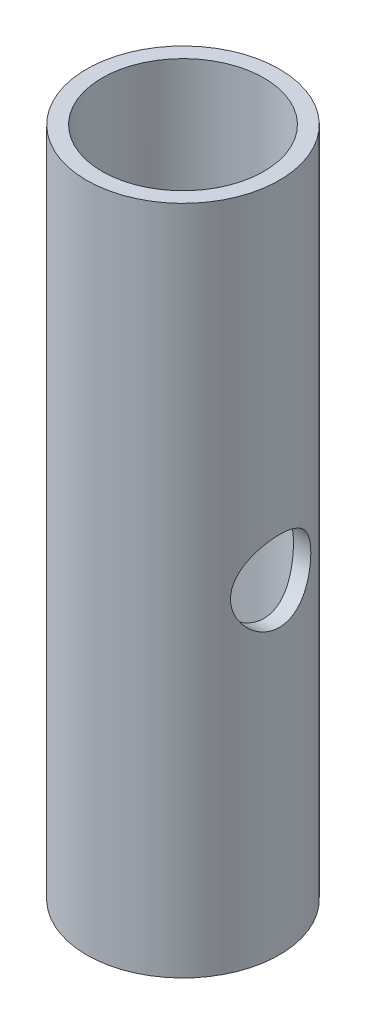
ISO-10303-21;
HEADER;
FILE_DESCRIPTION(('STEP AP214'),'2;1');
FILE_NAME('part.step','',(''),(''),'','','');
FILE_SCHEMA(('AUTOMOTIVE_DESIGN { 1 0 10303 214 1 1 1 1 }'));
ENDSEC;
DATA;
#1=APPLICATION_CONTEXT('core data for automotive mechanical design processes');
#2=APPLICATION_PROTOCOL_DEFINITION('international standard','automotive_design',2000,#1);
#3=PRODUCT_CONTEXT('',#1,'mechanical');
#4=PRODUCT('Part','Part','',(#3));
#5=PRODUCT_RELATED_PRODUCT_CATEGORY('part','',(#4));
#6=PRODUCT_DEFINITION_FORMATION('','',#4);
#7=PRODUCT_DEFINITION_CONTEXT('part definition',#1,'design');
#8=PRODUCT_DEFINITION('design','',#6,#7);
#9=PRODUCT_DEFINITION_SHAPE('','',#8);
#10=(LENGTH_UNIT() NAMED_UNIT(*) SI_UNIT(.MILLI.,.METRE.));
#11=(NAMED_UNIT(*) PLANE_ANGLE_UNIT() SI_UNIT($,.RADIAN.));
#12=(NAMED_UNIT(*) SI_UNIT($,.STERADIAN.) SOLID_ANGLE_UNIT());
#13=UNCERTAINTY_MEASURE_WITH_UNIT(LENGTH_MEASURE(1.E-05),#10,'distance_accuracy_value','');
#14=(GEOMETRIC_REPRESENTATION_CONTEXT(3) GLOBAL_UNCERTAINTY_ASSIGNED_CONTEXT((#13)) GLOBAL_UNIT_ASSIGNED_CONTEXT((#10,
#11,#12)) REPRESENTATION_CONTEXT('',''));
#15=CARTESIAN_POINT('',(0.,0.,0.));
#16=DIRECTION('',(0.,0.,1.));
#17=DIRECTION('',(1.,0.,0.));
#18=AXIS2_PLACEMENT_3D('',#15,#16,#17);
#19=CARTESIAN_POINT('',(0.,16.5735,0.));
#20=DIRECTION('',(0.,1.,0.));
#21=DIRECTION('',(0.,0.,1.));
#22=AXIS2_PLACEMENT_3D('',#19,#20,#21);
#23=PLANE('',#22);
#24=CARTESIAN_POINT('',(0.,16.5735,0.));
#25=DIRECTION('',(0.,1.,0.));
#26=DIRECTION('',(0.,0.,1.));
#27=AXIS2_PLACEMENT_3D('',#24,#25,#26);
#28=CIRCLE('',#27,2.38125);
#29=CARTESIAN_POINT('',(0.,16.5735,2.38125));
#30=VERTEX_POINT('',#29);
#31=EDGE_CURVE('E10',#30,#30,#28,.T.);
#32=ORIENTED_EDGE('',*,*,#31,.T.);
#33=EDGE_LOOP('',(#32));
#34=FACE_BOUND('',#33,.T.);
#35=CARTESIAN_POINT('',(0.,16.5735,0.));
#36=DIRECTION('',(0.,1.,0.));
#37=DIRECTION('',(0.,0.,1.));
#38=AXIS2_PLACEMENT_3D('',#35,#36,#37);
#39=CIRCLE('',#38,2.);
#40=CARTESIAN_POINT('',(0.,16.5735,2.));
#41=VERTEX_POINT('',#40);
#42=EDGE_CURVE('E54',#41,#41,#39,.T.);
#43=ORIENTED_EDGE('',*,*,#42,.F.);
#44=EDGE_LOOP('',(#43));
#45=FACE_BOUND('',#44,.T.);
#46=ADVANCED_FACE('F35',(#34,#45),#23,.T.);
#47=CARTESIAN_POINT('',(0.,0.,0.));
#48=DIRECTION('',(0.,1.,0.));
#49=DIRECTION('',(0.,0.,1.));
#50=AXIS2_PLACEMENT_3D('',#47,#48,#49);
#51=PLANE('',#50);
#52=CARTESIAN_POINT('',(0.,0.,0.));
#53=DIRECTION('',(0.,1.,0.));
#54=DIRECTION('',(0.,0.,1.));
#55=AXIS2_PLACEMENT_3D('',#52,#53,#54);
#56=CIRCLE('',#55,2.38125);
#57=CARTESIAN_POINT('',(0.,0.,2.38125));
#58=VERTEX_POINT('',#57);
#59=EDGE_CURVE('E49',#58,#58,#56,.T.);
#60=ORIENTED_EDGE('',*,*,#59,.F.);
#61=EDGE_LOOP('',(#60));
#62=FACE_BOUND('',#61,.T.);
#63=CARTESIAN_POINT('',(0.,0.,0.));
#64=DIRECTION('',(0.,1.,0.));
#65=DIRECTION('',(0.,0.,1.));
#66=AXIS2_PLACEMENT_3D('',#63,#64,#65);
#67=CIRCLE('',#66,2.);
#68=CARTESIAN_POINT('',(0.,0.,2.));
#69=VERTEX_POINT('',#68);
#70=EDGE_CURVE('E57',#69,#69,#67,.T.);
#71=ORIENTED_EDGE('',*,*,#70,.T.);
#72=EDGE_LOOP('',(#71));
#73=FACE_BOUND('',#72,.T.);
#74=ADVANCED_FACE('F93',(#62,#73),#51,.F.);
#75=CARTESIAN_POINT('',(0.,16.5735,0.));
#76=DIRECTION('',(0.,-1.,0.));
#77=DIRECTION('',(0.,0.,-1.));
#78=AXIS2_PLACEMENT_3D('',#75,#76,#77);
#79=CYLINDRICAL_SURFACE('',#78,2.38125);
#80=CARTESIAN_POINT('',(-2.38125,7.0088125,0.));
#81=CARTESIAN_POINT('',(-2.38124570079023,7.00881821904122,-0.0531479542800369));
#82=CARTESIAN_POINT('',(-2.37945003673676,7.0131082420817,-0.106379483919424));
#83=CARTESIAN_POINT('',(-2.37244059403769,7.03011600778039,-0.211333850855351));
#84=CARTESIAN_POINT('',(-2.36721789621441,7.04285574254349,-0.263052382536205));
#85=CARTESIAN_POINT('',(-2.35391554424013,7.07621067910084,-0.363290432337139));
#86=CARTESIAN_POINT('',(-2.34584557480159,7.09679920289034,-0.411820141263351));
#87=CARTESIAN_POINT('',(-2.3276344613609,7.14515717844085,-0.504689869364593));
#88=CARTESIAN_POINT('',(-2.31749394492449,7.17292445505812,-0.549031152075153));
#89=CARTESIAN_POINT('',(-2.29558713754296,7.23632425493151,-0.634562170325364));
#90=CARTESIAN_POINT('',(-2.28376760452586,7.27225916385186,-0.67551400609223));
#91=CARTESIAN_POINT('',(-2.26006591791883,7.35033481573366,-0.751014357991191));
#92=CARTESIAN_POINT('',(-2.2481837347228,7.39247880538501,-0.785559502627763));
#93=CARTESIAN_POINT('',(-2.22504811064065,7.48429000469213,-0.848945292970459));
#94=CARTESIAN_POINT('',(-2.21385437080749,7.53422534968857,-0.877421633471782));
#95=CARTESIAN_POINT('',(-2.19420735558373,7.63871127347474,-0.925464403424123));
#96=CARTESIAN_POINT('',(-2.18575266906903,7.69325945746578,-0.94503542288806));
#97=CARTESIAN_POINT('',(-2.17311728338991,7.80268449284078,-0.973729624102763));
#98=CARTESIAN_POINT('',(-2.16875032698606,7.85741894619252,-0.983310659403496));
#99=CARTESIAN_POINT('',(-2.16424927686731,7.96787942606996,-0.993181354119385));
#100=CARTESIAN_POINT('',(-2.1641128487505,8.02360488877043,-0.99347613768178));
#101=CARTESIAN_POINT('',(-2.16793063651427,8.12990504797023,-0.985110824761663));
#102=CARTESIAN_POINT('',(-2.17157206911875,8.18054712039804,-0.97713546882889));
#103=CARTESIAN_POINT('',(-2.18200670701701,8.27969522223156,-0.953604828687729));
#104=CARTESIAN_POINT('',(-2.18880051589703,8.32820084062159,-0.938048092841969));
#105=CARTESIAN_POINT('',(-2.20492784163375,8.42292392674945,-0.899493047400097));
#106=CARTESIAN_POINT('',(-2.21431232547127,8.46907074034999,-0.876343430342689));
#107=CARTESIAN_POINT('',(-2.23455175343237,8.55700420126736,-0.823366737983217));
#108=CARTESIAN_POINT('',(-2.24540727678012,8.59878911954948,-0.793537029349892));
#109=CARTESIAN_POINT('',(-2.26848175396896,8.68052934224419,-0.725087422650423));
#110=CARTESIAN_POINT('',(-2.280738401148,8.72003158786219,-0.685937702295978));
#111=CARTESIAN_POINT('',(-2.3044600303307,8.79206196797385,-0.601447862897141));
#112=CARTESIAN_POINT('',(-2.31592482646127,8.82458846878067,-0.556106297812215));
#113=CARTESIAN_POINT('',(-2.3371038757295,8.88240843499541,-0.45914305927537));
#114=CARTESIAN_POINT('',(-2.34677161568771,8.90751762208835,-0.407400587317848));
#115=CARTESIAN_POINT('',(-2.36291025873,8.94851615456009,-0.299920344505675));
#116=CARTESIAN_POINT('',(-2.36938292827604,8.9644105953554,-0.244184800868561));
#117=CARTESIAN_POINT('',(-2.37807215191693,8.98558019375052,-0.134086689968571));
#118=CARTESIAN_POINT('',(-2.38053198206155,8.99146336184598,-0.0798602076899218));
#119=CARTESIAN_POINT('',(-2.38169489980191,8.99425606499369,0.0288565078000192));
#120=CARTESIAN_POINT('',(-2.38039906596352,8.99116817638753,0.0833466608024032));
#121=CARTESIAN_POINT('',(-2.37435404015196,8.97654170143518,0.188196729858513));
#122=CARTESIAN_POINT('',(-2.36977941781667,8.96543009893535,0.238627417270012));
#123=CARTESIAN_POINT('',(-2.35782331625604,8.93566587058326,0.336853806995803));
#124=CARTESIAN_POINT('',(-2.35044148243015,8.91701229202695,0.384649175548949));
#125=CARTESIAN_POINT('',(-2.333293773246,8.87208428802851,0.477924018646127));
#126=CARTESIAN_POINT('',(-2.32346096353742,8.84559112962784,0.523285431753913));
#127=CARTESIAN_POINT('',(-2.30246082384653,8.78597638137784,0.609081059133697));
#128=CARTESIAN_POINT('',(-2.29129293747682,8.75285202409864,0.649513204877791));
#129=CARTESIAN_POINT('',(-2.26783969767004,8.67814555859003,0.727339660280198));
#130=CARTESIAN_POINT('',(-2.25553152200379,8.63612818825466,0.764310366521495));
#131=CARTESIAN_POINT('',(-2.23190067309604,8.54628936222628,0.830794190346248));
#132=CARTESIAN_POINT('',(-2.22057822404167,8.49846659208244,0.860305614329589));
#133=CARTESIAN_POINT('',(-2.20012725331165,8.39738749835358,0.911351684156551));
#134=CARTESIAN_POINT('',(-2.1910322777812,8.34406348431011,0.932766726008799));
#135=CARTESIAN_POINT('',(-2.17652882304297,8.23406834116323,0.966131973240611));
#136=CARTESIAN_POINT('',(-2.17111730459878,8.17740001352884,0.978089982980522));
#137=CARTESIAN_POINT('',(-2.16505761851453,8.06702515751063,0.9914261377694));
#138=CARTESIAN_POINT('',(-2.16407484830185,8.01342642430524,0.993547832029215));
#139=CARTESIAN_POINT('',(-2.166094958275,7.90666847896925,0.989136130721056));
#140=CARTESIAN_POINT('',(-2.16909722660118,7.85350920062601,0.982604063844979));
#141=CARTESIAN_POINT('',(-2.17844331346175,7.75168888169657,0.961694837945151));
#142=CARTESIAN_POINT('',(-2.18462506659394,7.70293364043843,0.947697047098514));
#143=CARTESIAN_POINT('',(-2.19950650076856,7.6084525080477,0.912624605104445));
#144=CARTESIAN_POINT('',(-2.20820688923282,7.56272747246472,0.891547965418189));
#145=CARTESIAN_POINT('',(-2.2277939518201,7.47260388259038,0.841456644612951));
#146=CARTESIAN_POINT('',(-2.23878062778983,7.42845040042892,0.812040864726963));
#147=CARTESIAN_POINT('',(-2.26142303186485,7.34547351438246,0.746667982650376));
#148=CARTESIAN_POINT('',(-2.27307899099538,7.30665196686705,0.710708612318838));
#149=CARTESIAN_POINT('',(-2.29676636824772,7.23253198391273,0.630159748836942));
#150=CARTESIAN_POINT('',(-2.30876330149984,7.19769608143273,0.585132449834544));
#151=CARTESIAN_POINT('',(-2.33092738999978,7.13605105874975,0.48942631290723));
#152=CARTESIAN_POINT('',(-2.34109371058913,7.10924559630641,0.438744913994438));
#153=CARTESIAN_POINT('',(-2.35830414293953,7.06500218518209,0.333956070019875));
#154=CARTESIAN_POINT('',(-2.36539708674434,7.04741671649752,0.279919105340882));
#155=CARTESIAN_POINT('',(-2.37586051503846,7.02174560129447,0.169394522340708));
#156=CARTESIAN_POINT('',(-2.37924265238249,7.0136302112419,0.112915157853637));
#157=CARTESIAN_POINT('',(-2.38103003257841,7.00934180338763,0.0374936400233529));
#158=CARTESIAN_POINT('',(-2.38125151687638,7.00881048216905,0.0187520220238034));
#159=CARTESIAN_POINT('',(-2.38125,7.0088125,0.));
#160=B_SPLINE_CURVE_WITH_KNOTS('',3,(#80,#81,#82,#83,#84,#85,#86,#87,#88,#89,#90,#91,#92,#93,
#94,#95,#96,#97,#98,#99,#100,#101,#102,#103,#104,#105,#106,#107,#108,#109,#110,#111,#112,#113,
#114,#115,#116,#117,#118,#119,#120,#121,#122,#123,#124,#125,#126,#127,#128,#129,#130,#131,#132,
#133,#134,#135,#136,#137,#138,#139,#140,#141,#142,#143,#144,#145,#146,#147,#148,#149,#150,#151,
#152,#153,#154,#155,#156,#157,#158,#159),.UNSPECIFIED.,.T.,.F.,(4,2,2,2,2,2,2,2,2,2,2,2,2,2,2,2,
2,2,2,2,2,2,2,2,2,2,2,2,2,2,2,2,2,2,2,2,2,2,2,4),(0.,0.159390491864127,0.319197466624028,
0.478466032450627,0.637686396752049,0.804211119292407,0.970823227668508,1.14563306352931,
1.32035269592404,1.48665623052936,1.65286799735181,1.80633812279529,1.95983764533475,
2.11660353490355,2.27343133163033,2.44351287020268,2.61363419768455,2.78768218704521,
2.96163384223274,3.12458451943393,3.28748840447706,3.44230793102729,3.59714702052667,
3.75679601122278,3.91651176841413,4.08764174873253,4.25881054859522,4.43241738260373,
4.60588079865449,4.76599152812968,4.9260776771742,5.07871134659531,5.2313879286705,
5.3932446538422,5.55515758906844,5.72886312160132,5.90264765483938,6.07355954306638,
6.24393317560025,6.3001704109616),.UNSPECIFIED.);
#161=CARTESIAN_POINT('',(-2.38125,7.0088125,0.));
#162=VERTEX_POINT('',#161);
#163=EDGE_CURVE('E82',#162,#162,#160,.T.);
#164=ORIENTED_EDGE('',*,*,#163,.T.);
#165=EDGE_LOOP('',(#164));
#166=FACE_BOUND('',#165,.T.);
#167=CARTESIAN_POINT('',(2.16469756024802,8.001,-0.992187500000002));
#168=CARTESIAN_POINT('',(2.16470324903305,7.94807918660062,-0.992181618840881));
#169=CARTESIAN_POINT('',(2.1666665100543,7.89507195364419,-0.98792668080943));
#170=CARTESIAN_POINT('',(2.17427042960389,7.79058723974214,-0.971071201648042));
#171=CARTESIAN_POINT('',(2.17992107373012,7.73911431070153,-0.958447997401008));
#172=CARTESIAN_POINT('',(2.19413865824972,7.63939835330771,-0.925433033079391));
#173=CARTESIAN_POINT('',(2.20269369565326,7.59114308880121,-0.905072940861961));
#174=CARTESIAN_POINT('',(2.22173917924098,7.49874718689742,-0.857255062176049));
#175=CARTESIAN_POINT('',(2.23222916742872,7.45460557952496,-0.829798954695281));
#176=CARTESIAN_POINT('',(2.25469261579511,7.36891645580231,-0.766741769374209));
#177=CARTESIAN_POINT('',(2.26671638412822,7.32765587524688,-0.730768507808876));
#178=CARTESIAN_POINT('',(2.29047909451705,7.25154107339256,-0.652479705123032));
#179=CARTESIAN_POINT('',(2.30221792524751,7.21668932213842,-0.610161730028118));
#180=CARTESIAN_POINT('',(2.32469958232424,7.15291818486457,-0.518130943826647));
#181=CARTESIAN_POINT('',(2.33537712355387,7.12432167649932,-0.468177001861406));
#182=CARTESIAN_POINT('',(2.35391737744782,7.07606215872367,-0.363642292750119));
#183=CARTESIAN_POINT('',(2.36178133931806,7.0563951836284,-0.30906359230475));
#184=CARTESIAN_POINT('',(2.37345157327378,7.02759305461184,-0.199841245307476));
#185=CARTESIAN_POINT('',(2.37744770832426,7.0179630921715,-0.14534878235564));
#186=CARTESIAN_POINT('',(2.38162170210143,7.00790949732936,-0.0353847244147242));
#187=CARTESIAN_POINT('',(2.38180110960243,7.0074821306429,0.0200864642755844));
#188=CARTESIAN_POINT('',(2.37843321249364,7.01558658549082,0.126835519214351));
#189=CARTESIAN_POINT('',(2.37511204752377,7.02357474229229,0.178163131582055));
#190=CARTESIAN_POINT('',(2.36542672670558,7.04735152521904,0.278672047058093));
#191=CARTESIAN_POINT('',(2.35906234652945,7.06314072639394,0.32785319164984));
#192=CARTESIAN_POINT('',(2.34378382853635,7.10225913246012,0.423575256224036));
#193=CARTESIAN_POINT('',(2.3348322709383,7.12569969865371,0.470064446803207));
#194=CARTESIAN_POINT('',(2.31525535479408,7.17934631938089,0.558571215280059));
#195=CARTESIAN_POINT('',(2.3046294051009,7.20955476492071,0.600587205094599));
#196=CARTESIAN_POINT('',(2.28188598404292,7.27835604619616,0.682101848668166));
#197=CARTESIAN_POINT('',(2.26971617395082,7.31738979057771,0.721214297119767));
#198=CARTESIAN_POINT('',(2.24581926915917,7.40148970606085,0.792504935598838));
#199=CARTESIAN_POINT('',(2.23409234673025,7.44655819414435,0.824680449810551));
#200=CARTESIAN_POINT('',(2.2120352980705,7.54331981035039,0.88217525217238));
#201=CARTESIAN_POINT('',(2.20176374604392,7.59518198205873,0.907234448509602));
#202=CARTESIAN_POINT('',(2.18447813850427,7.70293182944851,0.948106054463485));
#203=CARTESIAN_POINT('',(2.17746175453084,7.75881659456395,0.963925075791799));
#204=CARTESIAN_POINT('',(2.1680583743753,7.86915559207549,0.984885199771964));
#205=CARTESIAN_POINT('',(2.16540055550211,7.92346739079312,0.990652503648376));
#206=CARTESIAN_POINT('',(2.16424102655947,8.03233604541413,0.993184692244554));
#207=CARTESIAN_POINT('',(2.16573787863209,8.08689281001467,0.98995269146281));
#208=CARTESIAN_POINT('',(2.17243923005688,8.19102246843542,0.975149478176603));
#209=CARTESIAN_POINT('',(2.1774002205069,8.24069082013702,0.96412541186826));
#210=CARTESIAN_POINT('',(2.19015969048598,8.33743196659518,0.934776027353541));
#211=CARTESIAN_POINT('',(2.19795883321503,8.38450415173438,0.91644900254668));
#212=CARTESIAN_POINT('',(2.21591820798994,8.47694465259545,0.87215282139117));
#213=CARTESIAN_POINT('',(2.22616444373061,8.52215638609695,0.845892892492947));
#214=CARTESIAN_POINT('',(2.24774127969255,8.6077488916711,0.786765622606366));
#215=CARTESIAN_POINT('',(2.25907234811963,8.64812756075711,0.753895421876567));
#216=CARTESIAN_POINT('',(2.28265529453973,8.72632885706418,0.679326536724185));
#217=CARTESIAN_POINT('',(2.29490703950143,8.76367579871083,0.637126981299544));
#218=CARTESIAN_POINT('',(2.31809417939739,8.83084363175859,0.546775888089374));
#219=CARTESIAN_POINT('',(2.32902947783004,8.86066397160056,0.498623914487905));
#220=CARTESIAN_POINT('',(2.3484224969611,8.91189946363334,0.39739465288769));
#221=CARTESIAN_POINT('',(2.35687380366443,8.93329290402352,0.344305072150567));
#222=CARTESIAN_POINT('',(2.37028174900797,8.96668957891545,0.23483795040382));
#223=CARTESIAN_POINT('',(2.37524046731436,8.97869840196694,0.178462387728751));
#224=CARTESIAN_POINT('',(2.38086530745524,8.99228113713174,0.0682756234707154));
#225=CARTESIAN_POINT('',(2.38180724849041,8.99452576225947,0.0145606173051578));
#226=CARTESIAN_POINT('',(2.38005559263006,8.99031956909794,-0.0924614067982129));
#227=CARTESIAN_POINT('',(2.37736263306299,8.98387027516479,-0.145768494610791));
#228=CARTESIAN_POINT('',(2.36878864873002,8.96294080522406,-0.248512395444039));
#229=CARTESIAN_POINT('',(2.36302410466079,8.9487536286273,-0.298019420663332));
#230=CARTESIAN_POINT('',(2.34894040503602,8.91307094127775,-0.393931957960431));
#231=CARTESIAN_POINT('',(2.34062076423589,8.89157404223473,-0.44033687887));
#232=CARTESIAN_POINT('',(2.32176498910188,8.84079581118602,-0.531038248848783));
#233=CARTESIAN_POINT('',(2.31114567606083,8.81120657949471,-0.575144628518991));
#234=CARTESIAN_POINT('',(2.28894927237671,8.74553179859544,-0.657954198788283));
#235=CARTESIAN_POINT('',(2.27737182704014,8.70944383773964,-0.696655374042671));
#236=CARTESIAN_POINT('',(2.25357408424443,8.62890004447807,-0.770294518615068));
#237=CARTESIAN_POINT('',(2.24136365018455,8.58404190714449,-0.804797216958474));
#238=CARTESIAN_POINT('',(2.21849594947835,8.4887921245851,-0.865848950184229));
#239=CARTESIAN_POINT('',(2.20783955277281,8.43839740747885,-0.892393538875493));
#240=CARTESIAN_POINT('',(2.18950030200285,8.33362583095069,-0.936488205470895));
#241=CARTESIAN_POINT('',(2.18180169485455,8.27927195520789,-0.954086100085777));
#242=CARTESIAN_POINT('',(2.17043637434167,8.16805296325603,-0.979674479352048));
#243=CARTESIAN_POINT('',(2.16675614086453,8.11119694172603,-0.987697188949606));
#244=CARTESIAN_POINT('',(2.16491327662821,8.03643417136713,-0.991714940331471));
#245=CARTESIAN_POINT('',(2.16469565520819,8.01872193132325,-0.992189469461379));
#246=CARTESIAN_POINT('',(2.16469756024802,8.001,-0.992187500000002));
#247=B_SPLINE_CURVE_WITH_KNOTS('',3,(#167,#168,#169,#170,#171,#172,#173,#174,#175,#176,#177,
#178,#179,#180,#181,#182,#183,#184,#185,#186,#187,#188,#189,#190,#191,#192,#193,#194,#195,#196,
#197,#198,#199,#200,#201,#202,#203,#204,#205,#206,#207,#208,#209,#210,#211,#212,#213,#214,#215,
#216,#217,#218,#219,#220,#221,#222,#223,#224,#225,#226,#227,#228,#229,#230,#231,#232,#233,#234,
#235,#236,#237,#238,#239,#240,#241,#242,#243,#244,#245,#246),.UNSPECIFIED.,.T.,.F.,(4,2,2,2,2,2,
2,2,2,2,2,2,2,2,2,2,2,2,2,2,2,2,2,2,2,2,2,2,2,2,2,2,2,2,2,2,2,2,2,4),(0.,0.158711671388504,
0.317854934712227,0.476353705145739,0.634815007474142,0.802218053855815,0.969685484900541,
1.14441665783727,1.3190701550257,1.48463480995,1.65013227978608,1.80555773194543,
1.96099464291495,2.11880302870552,2.27666725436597,2.4456590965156,2.61471600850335,
2.78932914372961,2.96381718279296,3.12698430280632,3.29009496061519,3.4427628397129,
3.59546641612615,3.75463694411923,3.91387648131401,4.08607944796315,4.25829503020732,
4.43095146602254,4.60350500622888,4.76399729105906,4.9244614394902,5.07923335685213,
5.23403468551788,5.39583203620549,5.55768955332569,5.73056088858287,5.90352862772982,
6.07556193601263,6.24701462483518,6.30016341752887),.UNSPECIFIED.);
#248=CARTESIAN_POINT('',(2.16469756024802,8.001,-0.992187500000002));
#249=VERTEX_POINT('',#248);
#250=EDGE_CURVE('E77',#249,#249,#247,.T.);
#251=ORIENTED_EDGE('',*,*,#250,.T.);
#252=EDGE_LOOP('',(#251));
#253=FACE_BOUND('',#252,.T.);
#254=ORIENTED_EDGE('',*,*,#31,.F.);
#255=EDGE_LOOP('',(#254));
#256=FACE_BOUND('',#255,.T.);
#257=ORIENTED_EDGE('',*,*,#59,.T.);
#258=EDGE_LOOP('',(#257));
#259=FACE_BOUND('',#258,.T.);
#260=ADVANCED_FACE('F37',(#166,#253,#256,#259),#79,.T.);
#261=CARTESIAN_POINT('',(0.,16.5735,0.));
#262=DIRECTION('',(0.,-1.,0.));
#263=DIRECTION('',(0.,0.,-1.));
#264=AXIS2_PLACEMENT_3D('',#261,#262,#263);
#265=CYLINDRICAL_SURFACE('',#264,2.);
#266=CARTESIAN_POINT('',(-1.73653792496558,8.001,-0.992187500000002));
#267=CARTESIAN_POINT('',(-1.7365423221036,8.05276325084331,-0.992183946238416));
#268=CARTESIAN_POINT('',(-1.73888746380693,8.10459327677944,-0.98810974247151));
#269=CARTESIAN_POINT('',(-1.74793029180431,8.2066675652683,-0.972018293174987));
#270=CARTESIAN_POINT('',(-1.75463726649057,8.25690820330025,-0.959984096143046));
#271=CARTESIAN_POINT('',(-1.77143556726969,8.35413513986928,-0.928616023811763));
#272=CARTESIAN_POINT('',(-1.78150909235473,8.40113701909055,-0.90932047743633));
#273=CARTESIAN_POINT('',(-1.80387790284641,8.49122472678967,-0.864094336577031));
#274=CARTESIAN_POINT('',(-1.81617327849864,8.53431039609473,-0.838163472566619));
#275=CARTESIAN_POINT('',(-1.84281985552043,8.619203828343,-0.777935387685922));
#276=CARTESIAN_POINT('',(-1.85725691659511,8.66062436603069,-0.743130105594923));
#277=CARTESIAN_POINT('',(-1.88586664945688,8.7373405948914,-0.667198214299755));
#278=CARTESIAN_POINT('',(-1.90003918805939,8.77263327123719,-0.626068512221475));
#279=CARTESIAN_POINT('',(-1.92764389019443,8.83837439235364,-0.535331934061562));
#280=CARTESIAN_POINT('',(-1.94096518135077,8.86834839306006,-0.485344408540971));
#281=CARTESIAN_POINT('',(-1.9642548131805,8.91928520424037,-0.380251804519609));
#282=CARTESIAN_POINT('',(-1.97422523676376,8.94025361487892,-0.325149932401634));
#283=CARTESIAN_POINT('',(-1.98907145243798,8.97105668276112,-0.215493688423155));
#284=CARTESIAN_POINT('',(-1.99425586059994,8.98156983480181,-0.161172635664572));
#285=CARTESIAN_POINT('',(-2.00009658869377,8.99339636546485,-0.0513091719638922));
#286=CARTESIAN_POINT('',(-2.00075559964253,8.99471521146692,0.00423249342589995));
#287=CARTESIAN_POINT('',(-1.99761936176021,8.98838220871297,0.109867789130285));
#288=CARTESIAN_POINT('',(-1.99420073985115,8.98148893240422,0.160020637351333));
#289=CARTESIAN_POINT('',(-1.98386000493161,8.96028204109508,0.258348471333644));
#290=CARTESIAN_POINT('',(-1.97693763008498,8.94596787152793,0.30652330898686));
#291=CARTESIAN_POINT('',(-1.96010380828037,8.9102272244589,0.400375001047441));
#292=CARTESIAN_POINT('',(-1.95015187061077,8.88870397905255,0.44600744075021));
#293=CARTESIAN_POINT('',(-1.92815975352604,8.83928709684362,0.533124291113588));
#294=CARTESIAN_POINT('',(-1.91611882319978,8.81139116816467,0.574607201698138));
#295=CARTESIAN_POINT('',(-1.88975546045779,8.7470246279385,0.65638247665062));
#296=CARTESIAN_POINT('',(-1.87532497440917,8.709996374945,0.69620145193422));
#297=CARTESIAN_POINT('',(-1.84653662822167,8.62991166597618,0.769317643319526));
#298=CARTESIAN_POINT('',(-1.83217883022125,8.58685073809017,0.802609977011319));
#299=CARTESIAN_POINT('',(-1.80420431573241,8.49266187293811,0.86373986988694));
#300=CARTESIAN_POINT('',(-1.79068819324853,8.44119989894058,0.891113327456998));
#301=CARTESIAN_POINT('',(-1.76732160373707,8.33357295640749,0.936608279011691));
#302=CARTESIAN_POINT('',(-1.75746736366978,8.27741290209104,0.954739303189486));
#303=CARTESIAN_POINT('',(-1.74362549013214,8.16664627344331,0.97977606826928));
#304=CARTESIAN_POINT('',(-1.73923660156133,8.11226627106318,0.987454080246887));
#305=CARTESIAN_POINT('',(-1.73568019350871,8.00283052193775,0.993695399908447));
#306=CARTESIAN_POINT('',(-1.73650911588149,7.9477752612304,0.992264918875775));
#307=CARTESIAN_POINT('',(-1.74286940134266,7.84482126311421,0.981038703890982));
#308=CARTESIAN_POINT('',(-1.74788877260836,7.79678648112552,0.972153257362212));
#309=CARTESIAN_POINT('',(-1.76131286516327,7.70297824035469,0.94761336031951));
#310=CARTESIAN_POINT('',(-1.76971866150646,7.6572055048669,0.931956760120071));
#311=CARTESIAN_POINT('',(-1.78942657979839,7.56680775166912,0.893552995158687));
#312=CARTESIAN_POINT('',(-1.80084496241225,7.52233445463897,0.870510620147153));
#313=CARTESIAN_POINT('',(-1.82518509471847,7.43762998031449,0.818248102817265));
#314=CARTESIAN_POINT('',(-1.83810761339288,7.39740099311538,0.789024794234));
#315=CARTESIAN_POINT('',(-1.86592177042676,7.31712186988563,0.721003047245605));
#316=CARTESIAN_POINT('',(-1.88085925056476,7.27770944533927,0.681467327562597));
#317=CARTESIAN_POINT('',(-1.90963133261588,7.20588250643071,0.596101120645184));
#318=CARTESIAN_POINT('',(-1.92346557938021,7.17347023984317,0.550268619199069));
#319=CARTESIAN_POINT('',(-1.94892200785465,7.11589138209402,0.452036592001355));
#320=CARTESIAN_POINT('',(-1.96048068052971,7.09092484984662,0.39950218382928));
#321=CARTESIAN_POINT('',(-1.97960237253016,7.05043047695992,0.290240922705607));
#322=CARTESIAN_POINT('',(-1.98716884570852,7.03489447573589,0.233517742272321));
#323=CARTESIAN_POINT('',(-1.99691013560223,7.01502191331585,0.123051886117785));
#324=CARTESIAN_POINT('',(-1.99951226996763,7.00979624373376,0.0695064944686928));
#325=CARTESIAN_POINT('',(-2.00036167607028,7.00808286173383,-0.0377508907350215));
#326=CARTESIAN_POINT('',(-1.99861042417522,7.01159218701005,-0.0914628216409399));
#327=CARTESIAN_POINT('',(-1.99119899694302,7.02665532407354,-0.193899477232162));
#328=CARTESIAN_POINT('',(-1.98579707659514,7.03767804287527,-0.242722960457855));
#329=CARTESIAN_POINT('',(-1.9718600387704,7.06674613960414,-0.337751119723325));
#330=CARTESIAN_POINT('',(-1.96332446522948,7.08479253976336,-0.383955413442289));
#331=CARTESIAN_POINT('',(-1.9434339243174,7.12821168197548,-0.474673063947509));
#332=CARTESIAN_POINT('',(-1.93197309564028,7.15386722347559,-0.519027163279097));
#333=CARTESIAN_POINT('',(-1.90743910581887,7.21141954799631,-0.602986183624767));
#334=CARTESIAN_POINT('',(-1.89436520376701,7.24331920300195,-0.6425889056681));
#335=CARTESIAN_POINT('',(-1.86639574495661,7.31608694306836,-0.720015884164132));
#336=CARTESIAN_POINT('',(-1.85144733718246,7.35752796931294,-0.75728410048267));
#337=CARTESIAN_POINT('',(-1.82249383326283,7.44631183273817,-0.824536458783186));
#338=CARTESIAN_POINT('',(-1.80848955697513,7.49365970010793,-0.854514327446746));
#339=CARTESIAN_POINT('',(-1.78273152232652,7.59476773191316,-0.907056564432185));
#340=CARTESIAN_POINT('',(-1.77105556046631,7.64867493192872,-0.929378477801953));
#341=CARTESIAN_POINT('',(-1.75229996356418,7.76021588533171,-0.964286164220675));
#342=CARTESIAN_POINT('',(-1.74520495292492,7.81783645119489,-0.976904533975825));
#343=CARTESIAN_POINT('',(-1.73953193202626,7.89688959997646,-0.986931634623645));
#344=CARTESIAN_POINT('',(-1.73841298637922,7.91764274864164,-0.988899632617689));
#345=CARTESIAN_POINT('',(-1.73691507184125,7.95926030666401,-0.991528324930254));
#346=CARTESIAN_POINT('',(-1.73653615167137,7.98012472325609,-0.99218893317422));
#347=CARTESIAN_POINT('',(-1.73653792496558,8.001,-0.992187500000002));
#348=B_SPLINE_CURVE_WITH_KNOTS('',3,(#266,#267,#268,#269,#270,#271,#272,#273,#274,#275,#276,
#277,#278,#279,#280,#281,#282,#283,#284,#285,#286,#287,#288,#289,#290,#291,#292,#293,#294,#295,
#296,#297,#298,#299,#300,#301,#302,#303,#304,#305,#306,#307,#308,#309,#310,#311,#312,#313,#314,
#315,#316,#317,#318,#319,#320,#321,#322,#323,#324,#325,#326,#327,#328,#329,#330,#331,#332,#333,
#334,#335,#336,#337,#338,#339,#340,#341,#342,#343,#344,#345,#346,#347),.UNSPECIFIED.,.T.,.F.,(4,
2,2,2,2,2,2,2,2,2,2,2,2,2,2,2,2,2,2,2,2,2,2,2,2,2,2,2,2,2,2,2,2,2,2,2,2,2,2,2,4),(0.,
0.155201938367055,0.310735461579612,0.465459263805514,0.620189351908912,0.787471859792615,
0.954836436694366,1.13326450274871,1.31158145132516,1.4773753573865,1.64307066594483,
1.79457592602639,1.94609250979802,2.09973035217,2.25342353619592,2.42147705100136,
2.58965580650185,2.76822528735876,2.94661026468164,3.11093206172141,3.27514181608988,
3.4218033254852,3.56851143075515,3.72202460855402,3.87561661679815,4.04820820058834,
4.22085512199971,4.3977920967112,4.57457574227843,4.73530135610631,4.89597247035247,
5.04632523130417,5.19669988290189,5.35357020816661,5.51051285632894,5.68285899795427,
5.85535292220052,6.03289158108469,6.20983120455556,6.27241750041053,6.33500791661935),.UNSPECIFIED.);
#349=CARTESIAN_POINT('',(-1.73653792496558,8.001,-0.992187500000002));
#350=VERTEX_POINT('',#349);
#351=EDGE_CURVE('E40',#350,#350,#348,.T.);
#352=ORIENTED_EDGE('',*,*,#351,.F.);
#353=EDGE_LOOP('',(#352));
#354=FACE_BOUND('',#353,.T.);
#355=CARTESIAN_POINT('',(1.73653792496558,8.001,-0.992187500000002));
#356=CARTESIAN_POINT('',(1.73654232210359,7.94923674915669,-0.992183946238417));
#357=CARTESIAN_POINT('',(1.73888746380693,7.89740672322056,-0.98810974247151));
#358=CARTESIAN_POINT('',(1.74793029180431,7.7953324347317,-0.972018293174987));
#359=CARTESIAN_POINT('',(1.75463726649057,7.74509179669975,-0.959984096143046));
#360=CARTESIAN_POINT('',(1.77143556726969,7.64786486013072,-0.928616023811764));
#361=CARTESIAN_POINT('',(1.78150909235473,7.60086298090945,-0.909320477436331));
#362=CARTESIAN_POINT('',(1.80387790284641,7.51077527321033,-0.864094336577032));
#363=CARTESIAN_POINT('',(1.81617327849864,7.46768960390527,-0.83816347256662));
#364=CARTESIAN_POINT('',(1.84281985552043,7.382796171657,-0.777935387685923));
#365=CARTESIAN_POINT('',(1.85725691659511,7.34137563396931,-0.743130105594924));
#366=CARTESIAN_POINT('',(1.88586664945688,7.2646594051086,-0.667198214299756));
#367=CARTESIAN_POINT('',(1.90003918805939,7.22936672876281,-0.626068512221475));
#368=CARTESIAN_POINT('',(1.92764389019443,7.16362560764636,-0.535331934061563));
#369=CARTESIAN_POINT('',(1.94096518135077,7.13365160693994,-0.485344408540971));
#370=CARTESIAN_POINT('',(1.9642548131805,7.08271479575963,-0.38025180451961));
#371=CARTESIAN_POINT('',(1.97422523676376,7.06174638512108,-0.325149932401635));
#372=CARTESIAN_POINT('',(1.98907145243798,7.03094331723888,-0.215493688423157));
#373=CARTESIAN_POINT('',(1.99425586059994,7.02043016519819,-0.161172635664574));
#374=CARTESIAN_POINT('',(2.00009658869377,7.00860363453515,-0.051309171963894));
#375=CARTESIAN_POINT('',(2.00075559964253,7.00728478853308,0.00423249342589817));
#376=CARTESIAN_POINT('',(1.99761936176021,7.01361779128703,0.109867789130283));
#377=CARTESIAN_POINT('',(1.99420073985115,7.02051106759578,0.160020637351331));
#378=CARTESIAN_POINT('',(1.98386000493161,7.04171795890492,0.258348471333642));
#379=CARTESIAN_POINT('',(1.97693763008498,7.05603212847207,0.306523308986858));
#380=CARTESIAN_POINT('',(1.96010380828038,7.0917727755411,0.400375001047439));
#381=CARTESIAN_POINT('',(1.95015187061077,7.11329602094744,0.446007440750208));
#382=CARTESIAN_POINT('',(1.92815975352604,7.16271290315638,0.533124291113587));
#383=CARTESIAN_POINT('',(1.91611882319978,7.19060883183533,0.574607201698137));
#384=CARTESIAN_POINT('',(1.88975546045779,7.2549753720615,0.656382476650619));
#385=CARTESIAN_POINT('',(1.87532497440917,7.292003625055,0.696201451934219));
#386=CARTESIAN_POINT('',(1.84653662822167,7.37208833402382,0.769317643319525));
#387=CARTESIAN_POINT('',(1.83217883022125,7.41514926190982,0.802609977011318));
#388=CARTESIAN_POINT('',(1.80420431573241,7.50933812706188,0.863739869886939));
#389=CARTESIAN_POINT('',(1.79068819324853,7.56080010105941,0.891113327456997));
#390=CARTESIAN_POINT('',(1.76732160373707,7.66842704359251,0.93660827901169));
#391=CARTESIAN_POINT('',(1.75746736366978,7.72458709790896,0.954739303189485));
#392=CARTESIAN_POINT('',(1.74362549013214,7.83535372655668,0.979776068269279));
#393=CARTESIAN_POINT('',(1.73923660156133,7.88973372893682,0.987454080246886));
#394=CARTESIAN_POINT('',(1.73568019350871,7.99916947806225,0.993695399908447));
#395=CARTESIAN_POINT('',(1.73650911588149,8.05422473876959,0.992264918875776));
#396=CARTESIAN_POINT('',(1.74286940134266,8.15717873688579,0.981038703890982));
#397=CARTESIAN_POINT('',(1.74788877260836,8.20521351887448,0.972153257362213));
#398=CARTESIAN_POINT('',(1.76131286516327,8.2990217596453,0.947613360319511));
#399=CARTESIAN_POINT('',(1.76971866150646,8.3447944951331,0.931956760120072));
#400=CARTESIAN_POINT('',(1.78942657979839,8.43519224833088,0.893552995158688));
#401=CARTESIAN_POINT('',(1.80084496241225,8.47966554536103,0.870510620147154));
#402=CARTESIAN_POINT('',(1.82518509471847,8.5643700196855,0.818248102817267));
#403=CARTESIAN_POINT('',(1.83810761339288,8.60459900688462,0.789024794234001));
#404=CARTESIAN_POINT('',(1.86592177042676,8.68487813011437,0.721003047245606));
#405=CARTESIAN_POINT('',(1.88085925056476,8.72429055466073,0.681467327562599));
#406=CARTESIAN_POINT('',(1.90963133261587,8.79611749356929,0.596101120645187));
#407=CARTESIAN_POINT('',(1.92346557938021,8.82852976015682,0.550268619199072));
#408=CARTESIAN_POINT('',(1.94892200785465,8.88610861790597,0.452036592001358));
#409=CARTESIAN_POINT('',(1.9604806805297,8.91107515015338,0.399502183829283));
#410=CARTESIAN_POINT('',(1.97960237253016,8.95156952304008,0.29024092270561));
#411=CARTESIAN_POINT('',(1.98716884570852,8.96710552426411,0.233517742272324));
#412=CARTESIAN_POINT('',(1.99691013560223,8.98697808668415,0.123051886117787));
#413=CARTESIAN_POINT('',(1.99951226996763,8.99220375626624,0.0695064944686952));
#414=CARTESIAN_POINT('',(2.00036167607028,8.99391713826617,-0.0377508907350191));
#415=CARTESIAN_POINT('',(1.99861042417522,8.99040781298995,-0.0914628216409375));
#416=CARTESIAN_POINT('',(1.99119899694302,8.97534467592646,-0.19389947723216));
#417=CARTESIAN_POINT('',(1.98579707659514,8.96432195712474,-0.242722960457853));
#418=CARTESIAN_POINT('',(1.9718600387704,8.93525386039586,-0.337751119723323));
#419=CARTESIAN_POINT('',(1.96332446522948,8.91720746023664,-0.383955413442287));
#420=CARTESIAN_POINT('',(1.9434339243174,8.87378831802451,-0.474673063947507));
#421=CARTESIAN_POINT('',(1.93197309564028,8.84813277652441,-0.519027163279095));
#422=CARTESIAN_POINT('',(1.90743910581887,8.79058045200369,-0.602986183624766));
#423=CARTESIAN_POINT('',(1.89436520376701,8.75868079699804,-0.642588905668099));
#424=CARTESIAN_POINT('',(1.86639574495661,8.68591305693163,-0.720015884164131));
#425=CARTESIAN_POINT('',(1.85144733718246,8.64447203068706,-0.75728410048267));
#426=CARTESIAN_POINT('',(1.82249383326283,8.55568816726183,-0.824536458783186));
#427=CARTESIAN_POINT('',(1.80848955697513,8.50834029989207,-0.854514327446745));
#428=CARTESIAN_POINT('',(1.78273152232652,8.40723226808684,-0.907056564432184));
#429=CARTESIAN_POINT('',(1.77105556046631,8.35332506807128,-0.929378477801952));
#430=CARTESIAN_POINT('',(1.75229996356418,8.2417841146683,-0.964286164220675));
#431=CARTESIAN_POINT('',(1.74520495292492,8.18416354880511,-0.976904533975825));
#432=CARTESIAN_POINT('',(1.73953193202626,8.10511040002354,-0.986931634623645));
#433=CARTESIAN_POINT('',(1.73841298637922,8.08435725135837,-0.988899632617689));
#434=CARTESIAN_POINT('',(1.73691507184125,8.04273969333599,-0.991528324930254));
#435=CARTESIAN_POINT('',(1.73653615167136,8.02187527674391,-0.99218893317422));
#436=CARTESIAN_POINT('',(1.73653792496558,8.001,-0.992187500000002));
#437=B_SPLINE_CURVE_WITH_KNOTS('',3,(#355,#356,#357,#358,#359,#360,#361,#362,#363,#364,#365,
#366,#367,#368,#369,#370,#371,#372,#373,#374,#375,#376,#377,#378,#379,#380,#381,#382,#383,#384,
#385,#386,#387,#388,#389,#390,#391,#392,#393,#394,#395,#396,#397,#398,#399,#400,#401,#402,#403,
#404,#405,#406,#407,#408,#409,#410,#411,#412,#413,#414,#415,#416,#417,#418,#419,#420,#421,#422,
#423,#424,#425,#426,#427,#428,#429,#430,#431,#432,#433,#434,#435,#436),.UNSPECIFIED.,.T.,.F.,(4,
2,2,2,2,2,2,2,2,2,2,2,2,2,2,2,2,2,2,2,2,2,2,2,2,2,2,2,2,2,2,2,2,2,2,2,2,2,2,2,4),(0.,
0.155201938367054,0.310735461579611,0.465459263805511,0.620189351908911,0.787471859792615,
0.954836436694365,1.13326450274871,1.31158145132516,1.4773753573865,1.64307066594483,
1.79457592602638,1.94609250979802,2.09973035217,2.25342353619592,2.42147705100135,
2.58965580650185,2.76822528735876,2.94661026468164,3.11093206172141,3.27514181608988,
3.4218033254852,3.56851143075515,3.72202460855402,3.87561661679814,4.04820820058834,
4.22085512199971,4.39779209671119,4.57457574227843,4.73530135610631,4.89597247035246,
5.04632523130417,5.19669988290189,5.35357020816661,5.51051285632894,5.68285899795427,
5.85535292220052,6.03289158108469,6.20983120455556,6.27241750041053,6.33500791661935),.UNSPECIFIED.);
#438=CARTESIAN_POINT('',(1.73653792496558,8.001,-0.992187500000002));
#439=VERTEX_POINT('',#438);
#440=EDGE_CURVE('E59',#439,#439,#437,.T.);
#441=ORIENTED_EDGE('',*,*,#440,.F.);
#442=EDGE_LOOP('',(#441));
#443=FACE_BOUND('',#442,.T.);
#444=ORIENTED_EDGE('',*,*,#42,.T.);
#445=EDGE_LOOP('',(#444));
#446=FACE_BOUND('',#445,.T.);
#447=ORIENTED_EDGE('',*,*,#70,.F.);
#448=EDGE_LOOP('',(#447));
#449=FACE_BOUND('',#448,.T.);
#450=ADVANCED_FACE('F64',(#354,#443,#446,#449),#265,.F.);
#451=CARTESIAN_POINT('',(-2.38125,8.001,0.));
#452=DIRECTION('',(1.,0.,0.));
#453=DIRECTION('',(0.,0.,-1.));
#454=AXIS2_PLACEMENT_3D('',#451,#452,#453);
#455=CYLINDRICAL_SURFACE('',#454,0.992187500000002);
#456=ORIENTED_EDGE('',*,*,#440,.T.);
#457=EDGE_LOOP('',(#456));
#458=FACE_BOUND('',#457,.T.);
#459=ORIENTED_EDGE('',*,*,#250,.F.);
#460=EDGE_LOOP('',(#459));
#461=FACE_BOUND('',#460,.T.);
#462=ADVANCED_FACE('F70',(#458,#461),#455,.F.);
#463=ORIENTED_EDGE('',*,*,#351,.T.);
#464=EDGE_LOOP('',(#463));
#465=FACE_BOUND('',#464,.T.);
#466=ORIENTED_EDGE('',*,*,#163,.F.);
#467=EDGE_LOOP('',(#466));
#468=FACE_BOUND('',#467,.T.);
#469=ADVANCED_FACE('F67',(#465,#468),#455,.F.);
#470=CLOSED_SHELL('',(#46,#74,#260,#450,#462,#469));
#471=MANIFOLD_SOLID_BREP('B2',#470);
#472=ADVANCED_BREP_SHAPE_REPRESENTATION('',(#18,#471),#14);
#473=SHAPE_DEFINITION_REPRESENTATION(#9,#472);
ENDSEC;
END-ISO-10303-21;
